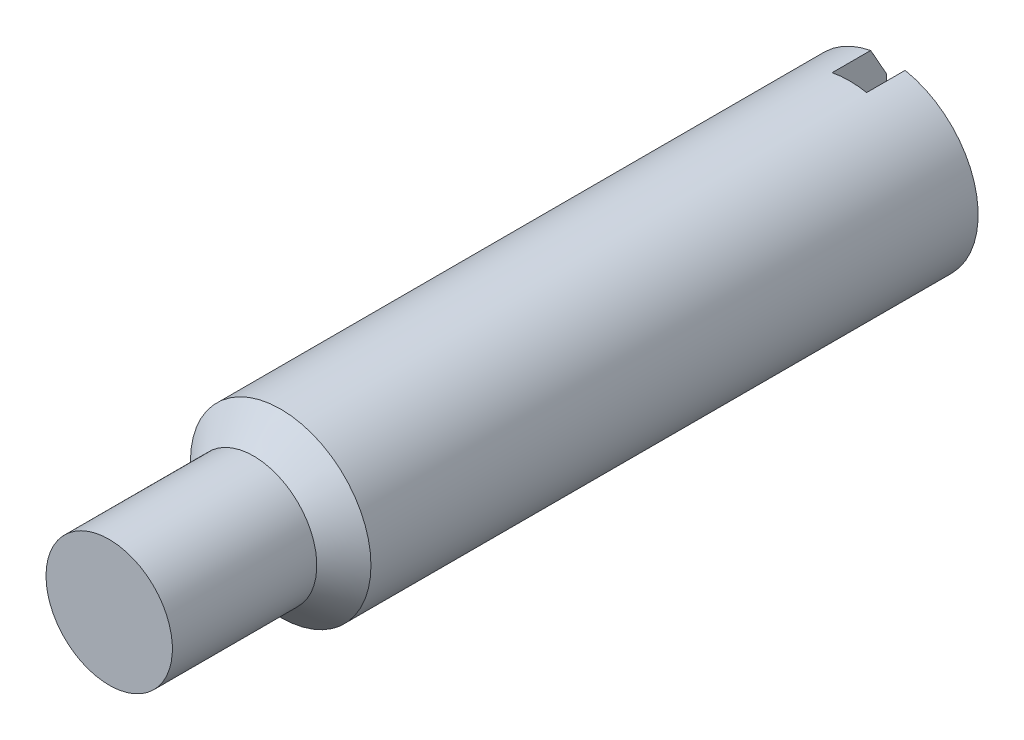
from build123d import *

# Parameters (mm, degrees)
FENTE_DEPTH      = 45.56455991
FENTE_DEPTH_BACK = 45.56455991
E_FENTE_W        = 1.91
E_FENTE_H        = 3


with BuildPart() as part:
    # E_corps → Corps (revolve)
    with BuildSketch(Plane(origin=(0, 0, 0), x_dir=(1, 0, 0), z_dir=(0, 1, 0)), mode=Mode.PRIVATE) as corps_sk:
        Polygon((0, 0), (3.5, 0), (5, -0.866025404), (5, -34.5), (3.5, -36), (3.5, -44), (0, -44), align=None)
    revolve(corps_sk.sketch.rotate(Axis((0, 0, -10), (0, 0, 1)), 180), axis=Axis((0, 0, -10), (0, 0, 1)))

    # E_fente → Fente (cut, two sides: drawn at the far end of the back side and taken through both)
    with BuildSketch(Plane(origin=(0, 0, 0), x_dir=(1, 0, 0), z_dir=(0, 1, 0)).offset(-FENTE_DEPTH_BACK)):
        with Locations((0, -1.5)):
            Rectangle(E_FENTE_W, E_FENTE_H)
    extrude(amount=FENTE_DEPTH + FENTE_DEPTH_BACK, mode=Mode.SUBTRACT)


solid = part.part
